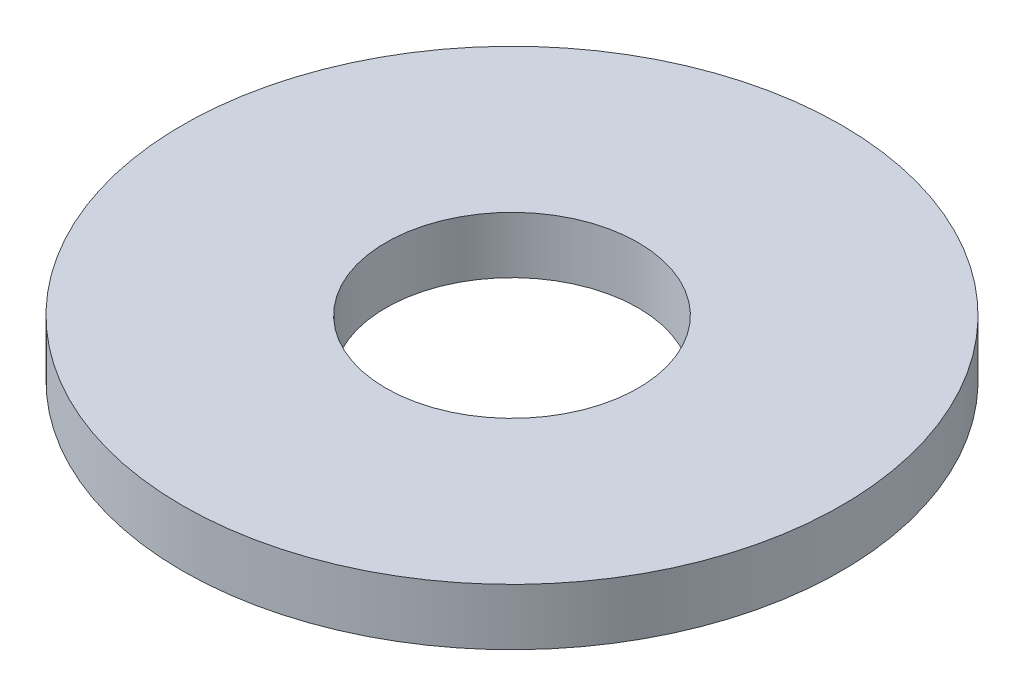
from build123d import *

# Parameters (mm, degrees)
SKETCH1_W = 5.7531
SKETCH1_H = 1.6002


with BuildPart() as part:
    # Sketch1 → Base-Revolve (revolve)
    with BuildSketch(Plane.XY, mode=Mode.PRIVATE) as base_revolve_sk:
        with Locations((6.44525, 0.8001)):
            Rectangle(SKETCH1_W, SKETCH1_H)
    revolve(base_revolve_sk.sketch.rotate(Axis((0, -80.01, 0), (0, 1, 0)), 90), axis=Axis((0, -80.01, 0), (0, 1, 0)))


solid = part.part
